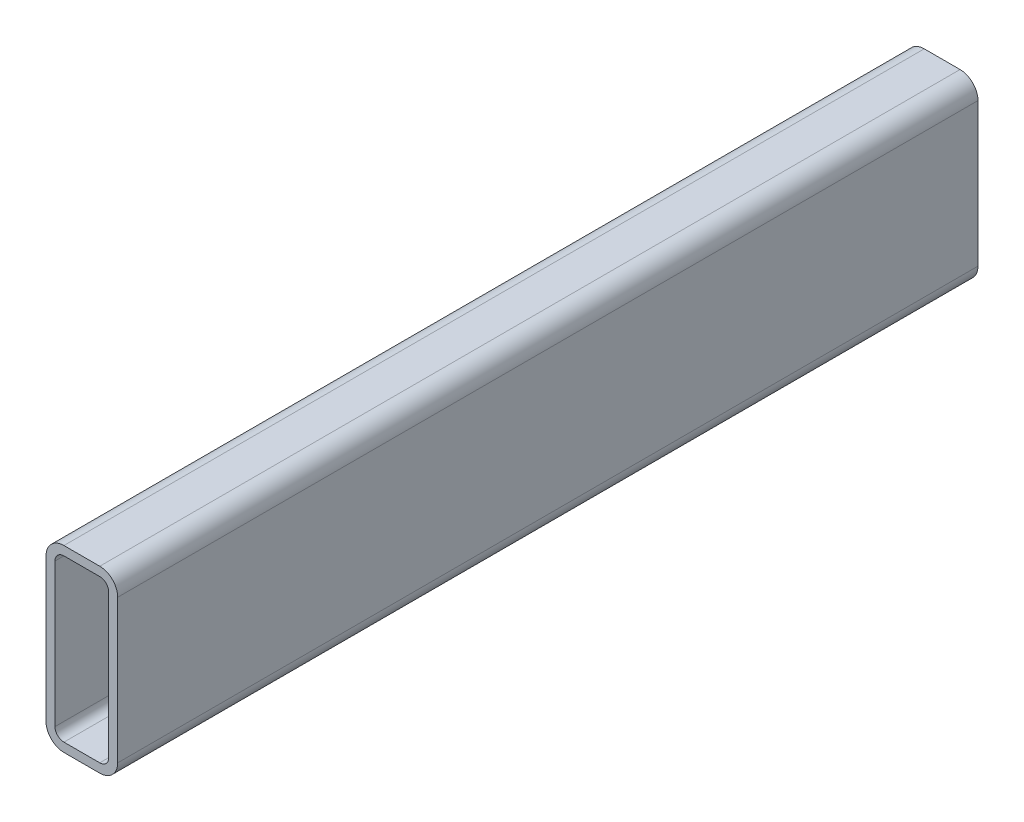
ISO-10303-21;
HEADER;
FILE_DESCRIPTION(('STEP AP214'),'2;1');
FILE_NAME('part.step','',(''),(''),'','','');
FILE_SCHEMA(('AUTOMOTIVE_DESIGN { 1 0 10303 214 1 1 1 1 }'));
ENDSEC;
DATA;
#1=APPLICATION_CONTEXT('core data for automotive mechanical design processes');
#2=APPLICATION_PROTOCOL_DEFINITION('international standard','automotive_design',2000,#1);
#3=PRODUCT_CONTEXT('',#1,'mechanical');
#4=PRODUCT('Part','Part','',(#3));
#5=PRODUCT_RELATED_PRODUCT_CATEGORY('part','',(#4));
#6=PRODUCT_DEFINITION_FORMATION('','',#4);
#7=PRODUCT_DEFINITION_CONTEXT('part definition',#1,'design');
#8=PRODUCT_DEFINITION('design','',#6,#7);
#9=PRODUCT_DEFINITION_SHAPE('','',#8);
#10=(LENGTH_UNIT() NAMED_UNIT(*) SI_UNIT(.MILLI.,.METRE.));
#11=(NAMED_UNIT(*) PLANE_ANGLE_UNIT() SI_UNIT($,.RADIAN.));
#12=(NAMED_UNIT(*) SI_UNIT($,.STERADIAN.) SOLID_ANGLE_UNIT());
#13=UNCERTAINTY_MEASURE_WITH_UNIT(LENGTH_MEASURE(1.E-05),#10,'distance_accuracy_value','');
#14=(GEOMETRIC_REPRESENTATION_CONTEXT(3) GLOBAL_UNCERTAINTY_ASSIGNED_CONTEXT((#13)) GLOBAL_UNIT_ASSIGNED_CONTEXT((#10,
#11,#12)) REPRESENTATION_CONTEXT('',''));
#15=CARTESIAN_POINT('',(0.,0.,0.));
#16=DIRECTION('',(0.,0.,1.));
#17=DIRECTION('',(1.,0.,0.));
#18=AXIS2_PLACEMENT_3D('',#15,#16,#17);
#19=CARTESIAN_POINT('',(6.35,57.15,304.8));
#20=DIRECTION('',(0.,0.,1.));
#21=DIRECTION('',(1.,0.,0.));
#22=AXIS2_PLACEMENT_3D('',#19,#20,#21);
#23=PLANE('',#22);
#24=CARTESIAN_POINT('',(6.35,57.15,304.8));
#25=DIRECTION('',(0.,0.,1.));
#26=DIRECTION('',(1.,0.,0.));
#27=AXIS2_PLACEMENT_3D('',#24,#25,#26);
#28=CIRCLE('',#27,6.35);
#29=CARTESIAN_POINT('',(6.35,63.5,304.8));
#30=VERTEX_POINT('',#29);
#31=CARTESIAN_POINT('',(0.,57.15,304.8));
#32=VERTEX_POINT('',#31);
#33=EDGE_CURVE('E213',#30,#32,#28,.T.);
#34=ORIENTED_EDGE('',*,*,#33,.T.);
#35=DIRECTION('',(0.,-1.,0.));
#36=VECTOR('',#35,1.);
#37=CARTESIAN_POINT('',(0.,6.35,304.8));
#38=LINE('',#37,#36);
#39=CARTESIAN_POINT('',(0.,6.35,304.8));
#40=VERTEX_POINT('',#39);
#41=EDGE_CURVE('E216',#32,#40,#38,.T.);
#42=ORIENTED_EDGE('',*,*,#41,.T.);
#43=CARTESIAN_POINT('',(6.35,6.35,304.8));
#44=DIRECTION('',(0.,0.,1.));
#45=DIRECTION('',(1.,0.,0.));
#46=AXIS2_PLACEMENT_3D('',#43,#44,#45);
#47=CIRCLE('',#46,6.35);
#48=CARTESIAN_POINT('',(6.35,0.,304.8));
#49=VERTEX_POINT('',#48);
#50=EDGE_CURVE('E219',#40,#49,#47,.T.);
#51=ORIENTED_EDGE('',*,*,#50,.T.);
#52=DIRECTION('',(1.,0.,0.));
#53=VECTOR('',#52,1.);
#54=CARTESIAN_POINT('',(19.05,0.,304.8));
#55=LINE('',#54,#53);
#56=CARTESIAN_POINT('',(19.05,0.,304.8));
#57=VERTEX_POINT('',#56);
#58=EDGE_CURVE('E221',#49,#57,#55,.T.);
#59=ORIENTED_EDGE('',*,*,#58,.T.);
#60=CARTESIAN_POINT('',(19.05,6.35,304.8));
#61=DIRECTION('',(0.,0.,1.));
#62=DIRECTION('',(1.,0.,0.));
#63=AXIS2_PLACEMENT_3D('',#60,#61,#62);
#64=CIRCLE('',#63,6.35);
#65=CARTESIAN_POINT('',(25.4,6.35,304.8));
#66=VERTEX_POINT('',#65);
#67=EDGE_CURVE('E223',#57,#66,#64,.T.);
#68=ORIENTED_EDGE('',*,*,#67,.T.);
#69=DIRECTION('',(0.,1.,0.));
#70=VECTOR('',#69,1.);
#71=CARTESIAN_POINT('',(25.4,57.15,304.8));
#72=LINE('',#71,#70);
#73=CARTESIAN_POINT('',(25.4,57.15,304.8));
#74=VERTEX_POINT('',#73);
#75=EDGE_CURVE('E225',#66,#74,#72,.T.);
#76=ORIENTED_EDGE('',*,*,#75,.T.);
#77=CARTESIAN_POINT('',(19.05,57.15,304.8));
#78=DIRECTION('',(0.,0.,1.));
#79=DIRECTION('',(1.,0.,0.));
#80=AXIS2_PLACEMENT_3D('',#77,#78,#79);
#81=CIRCLE('',#80,6.35);
#82=CARTESIAN_POINT('',(19.05,63.5,304.8));
#83=VERTEX_POINT('',#82);
#84=EDGE_CURVE('E227',#74,#83,#81,.T.);
#85=ORIENTED_EDGE('',*,*,#84,.T.);
#86=DIRECTION('',(-1.,0.,0.));
#87=VECTOR('',#86,1.);
#88=CARTESIAN_POINT('',(6.35,63.5,304.8));
#89=LINE('',#88,#87);
#90=EDGE_CURVE('E229',#83,#30,#89,.T.);
#91=ORIENTED_EDGE('',*,*,#90,.T.);
#92=EDGE_LOOP('',(#34,#42,#51,#59,#68,#76,#85,#91));
#93=FACE_BOUND('',#92,.T.);
#94=DIRECTION('',(0.,-1.,0.));
#95=VECTOR('',#94,1.);
#96=CARTESIAN_POINT('',(3.175,6.35,304.8));
#97=LINE('',#96,#95);
#98=CARTESIAN_POINT('',(3.175,57.15,304.8));
#99=VERTEX_POINT('',#98);
#100=CARTESIAN_POINT('',(3.175,6.35,304.8));
#101=VERTEX_POINT('',#100);
#102=EDGE_CURVE('E156',#99,#101,#97,.T.);
#103=ORIENTED_EDGE('',*,*,#102,.F.);
#104=CARTESIAN_POINT('',(6.35,57.15,304.8));
#105=DIRECTION('',(0.,0.,1.));
#106=DIRECTION('',(1.,0.,0.));
#107=AXIS2_PLACEMENT_3D('',#104,#105,#106);
#108=CIRCLE('',#107,3.17499999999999);
#109=CARTESIAN_POINT('',(6.35,60.325,304.8));
#110=VERTEX_POINT('',#109);
#111=EDGE_CURVE('E148',#110,#99,#108,.T.);
#112=ORIENTED_EDGE('',*,*,#111,.F.);
#113=DIRECTION('',(-1.,0.,0.));
#114=VECTOR('',#113,1.);
#115=CARTESIAN_POINT('',(6.35,60.325,304.8));
#116=LINE('',#115,#114);
#117=CARTESIAN_POINT('',(19.05,60.325,304.8));
#118=VERTEX_POINT('',#117);
#119=EDGE_CURVE('E181',#118,#110,#116,.T.);
#120=ORIENTED_EDGE('',*,*,#119,.F.);
#121=CARTESIAN_POINT('',(19.05,57.15,304.8));
#122=DIRECTION('',(0.,0.,1.));
#123=DIRECTION('',(1.,0.,0.));
#124=AXIS2_PLACEMENT_3D('',#121,#122,#123);
#125=CIRCLE('',#124,3.17499999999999);
#126=CARTESIAN_POINT('',(22.225,57.15,304.8));
#127=VERTEX_POINT('',#126);
#128=EDGE_CURVE('E179',#127,#118,#125,.T.);
#129=ORIENTED_EDGE('',*,*,#128,.F.);
#130=DIRECTION('',(0.,1.,0.));
#131=VECTOR('',#130,1.);
#132=CARTESIAN_POINT('',(22.225,57.15,304.8));
#133=LINE('',#132,#131);
#134=CARTESIAN_POINT('',(22.225,6.35,304.8));
#135=VERTEX_POINT('',#134);
#136=EDGE_CURVE('E177',#135,#127,#133,.T.);
#137=ORIENTED_EDGE('',*,*,#136,.F.);
#138=CARTESIAN_POINT('',(19.05,6.35,304.8));
#139=DIRECTION('',(0.,0.,1.));
#140=DIRECTION('',(1.,0.,0.));
#141=AXIS2_PLACEMENT_3D('',#138,#139,#140);
#142=CIRCLE('',#141,3.175);
#143=CARTESIAN_POINT('',(19.05,3.175,304.8));
#144=VERTEX_POINT('',#143);
#145=EDGE_CURVE('E175',#144,#135,#142,.T.);
#146=ORIENTED_EDGE('',*,*,#145,.F.);
#147=DIRECTION('',(1.,0.,0.));
#148=VECTOR('',#147,1.);
#149=CARTESIAN_POINT('',(19.05,3.175,304.8));
#150=LINE('',#149,#148);
#151=CARTESIAN_POINT('',(6.35,3.175,304.8));
#152=VERTEX_POINT('',#151);
#153=EDGE_CURVE('E171',#152,#144,#150,.T.);
#154=ORIENTED_EDGE('',*,*,#153,.F.);
#155=CARTESIAN_POINT('',(6.35,6.35,304.8));
#156=DIRECTION('',(0.,0.,1.));
#157=DIRECTION('',(1.,0.,0.));
#158=AXIS2_PLACEMENT_3D('',#155,#156,#157);
#159=CIRCLE('',#158,3.175);
#160=EDGE_CURVE('E169',#101,#152,#159,.T.);
#161=ORIENTED_EDGE('',*,*,#160,.F.);
#162=EDGE_LOOP('',(#103,#112,#120,#129,#137,#146,#154,#161));
#163=FACE_BOUND('',#162,.T.);
#164=ADVANCED_FACE('F35',(#93,#163),#23,.T.);
#165=CARTESIAN_POINT('',(6.35,57.15,0.));
#166=DIRECTION('',(0.,0.,1.));
#167=DIRECTION('',(1.,0.,0.));
#168=AXIS2_PLACEMENT_3D('',#165,#166,#167);
#169=PLANE('',#168);
#170=CARTESIAN_POINT('',(6.35,57.15,0.));
#171=DIRECTION('',(0.,0.,1.));
#172=DIRECTION('',(1.,0.,0.));
#173=AXIS2_PLACEMENT_3D('',#170,#171,#172);
#174=CIRCLE('',#173,6.35);
#175=CARTESIAN_POINT('',(6.35,63.5,0.));
#176=VERTEX_POINT('',#175);
#177=CARTESIAN_POINT('',(0.,57.15,0.));
#178=VERTEX_POINT('',#177);
#179=EDGE_CURVE('E164',#176,#178,#174,.T.);
#180=ORIENTED_EDGE('',*,*,#179,.F.);
#181=DIRECTION('',(-1.,0.,0.));
#182=VECTOR('',#181,1.);
#183=CARTESIAN_POINT('',(6.35,63.5,0.));
#184=LINE('',#183,#182);
#185=CARTESIAN_POINT('',(19.05,63.5,0.));
#186=VERTEX_POINT('',#185);
#187=EDGE_CURVE('E217',#186,#176,#184,.T.);
#188=ORIENTED_EDGE('',*,*,#187,.F.);
#189=CARTESIAN_POINT('',(19.05,57.15,0.));
#190=DIRECTION('',(0.,0.,1.));
#191=DIRECTION('',(1.,0.,0.));
#192=AXIS2_PLACEMENT_3D('',#189,#190,#191);
#193=CIRCLE('',#192,6.35);
#194=CARTESIAN_POINT('',(25.4,57.15,0.));
#195=VERTEX_POINT('',#194);
#196=EDGE_CURVE('E244',#195,#186,#193,.T.);
#197=ORIENTED_EDGE('',*,*,#196,.F.);
#198=DIRECTION('',(0.,1.,0.));
#199=VECTOR('',#198,1.);
#200=CARTESIAN_POINT('',(25.4,57.15,0.));
#201=LINE('',#200,#199);
#202=CARTESIAN_POINT('',(25.4,6.35,0.));
#203=VERTEX_POINT('',#202);
#204=EDGE_CURVE('E242',#203,#195,#201,.T.);
#205=ORIENTED_EDGE('',*,*,#204,.F.);
#206=CARTESIAN_POINT('',(19.05,6.35,0.));
#207=DIRECTION('',(0.,0.,1.));
#208=DIRECTION('',(1.,0.,0.));
#209=AXIS2_PLACEMENT_3D('',#206,#207,#208);
#210=CIRCLE('',#209,6.35);
#211=CARTESIAN_POINT('',(19.05,0.,0.));
#212=VERTEX_POINT('',#211);
#213=EDGE_CURVE('E240',#212,#203,#210,.T.);
#214=ORIENTED_EDGE('',*,*,#213,.F.);
#215=DIRECTION('',(1.,0.,0.));
#216=VECTOR('',#215,1.);
#217=CARTESIAN_POINT('',(19.05,0.,0.));
#218=LINE('',#217,#216);
#219=CARTESIAN_POINT('',(6.35,0.,0.));
#220=VERTEX_POINT('',#219);
#221=EDGE_CURVE('E238',#220,#212,#218,.T.);
#222=ORIENTED_EDGE('',*,*,#221,.F.);
#223=CARTESIAN_POINT('',(6.35,6.35,0.));
#224=DIRECTION('',(0.,0.,1.));
#225=DIRECTION('',(1.,0.,0.));
#226=AXIS2_PLACEMENT_3D('',#223,#224,#225);
#227=CIRCLE('',#226,6.35);
#228=CARTESIAN_POINT('',(0.,6.35,0.));
#229=VERTEX_POINT('',#228);
#230=EDGE_CURVE('E236',#229,#220,#227,.T.);
#231=ORIENTED_EDGE('',*,*,#230,.F.);
#232=DIRECTION('',(0.,-1.,0.));
#233=VECTOR('',#232,1.);
#234=CARTESIAN_POINT('',(0.,6.35,0.));
#235=LINE('',#234,#233);
#236=EDGE_CURVE('E234',#178,#229,#235,.T.);
#237=ORIENTED_EDGE('',*,*,#236,.F.);
#238=EDGE_LOOP('',(#180,#188,#197,#205,#214,#222,#231,#237));
#239=FACE_BOUND('',#238,.T.);
#240=CARTESIAN_POINT('',(6.35,57.15,0.));
#241=DIRECTION('',(0.,0.,1.));
#242=DIRECTION('',(1.,0.,0.));
#243=AXIS2_PLACEMENT_3D('',#240,#241,#242);
#244=CIRCLE('',#243,3.17499999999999);
#245=CARTESIAN_POINT('',(6.35,60.325,0.));
#246=VERTEX_POINT('',#245);
#247=CARTESIAN_POINT('',(3.175,57.15,0.));
#248=VERTEX_POINT('',#247);
#249=EDGE_CURVE('E58',#246,#248,#244,.T.);
#250=ORIENTED_EDGE('',*,*,#249,.T.);
#251=DIRECTION('',(0.,-1.,0.));
#252=VECTOR('',#251,1.);
#253=CARTESIAN_POINT('',(3.175,6.35,0.));
#254=LINE('',#253,#252);
#255=CARTESIAN_POINT('',(3.175,6.35,0.));
#256=VERTEX_POINT('',#255);
#257=EDGE_CURVE('E163',#248,#256,#254,.T.);
#258=ORIENTED_EDGE('',*,*,#257,.T.);
#259=CARTESIAN_POINT('',(6.35,6.35,0.));
#260=DIRECTION('',(0.,0.,1.));
#261=DIRECTION('',(1.,0.,0.));
#262=AXIS2_PLACEMENT_3D('',#259,#260,#261);
#263=CIRCLE('',#262,3.175);
#264=CARTESIAN_POINT('',(6.35,3.175,0.));
#265=VERTEX_POINT('',#264);
#266=EDGE_CURVE('E185',#256,#265,#263,.T.);
#267=ORIENTED_EDGE('',*,*,#266,.T.);
#268=DIRECTION('',(1.,0.,0.));
#269=VECTOR('',#268,1.);
#270=CARTESIAN_POINT('',(19.05,3.175,0.));
#271=LINE('',#270,#269);
#272=CARTESIAN_POINT('',(19.05,3.175,0.));
#273=VERTEX_POINT('',#272);
#274=EDGE_CURVE('E188',#265,#273,#271,.T.);
#275=ORIENTED_EDGE('',*,*,#274,.T.);
#276=CARTESIAN_POINT('',(19.05,6.35,0.));
#277=DIRECTION('',(0.,0.,1.));
#278=DIRECTION('',(1.,0.,0.));
#279=AXIS2_PLACEMENT_3D('',#276,#277,#278);
#280=CIRCLE('',#279,3.175);
#281=CARTESIAN_POINT('',(22.225,6.35,0.));
#282=VERTEX_POINT('',#281);
#283=EDGE_CURVE('E191',#273,#282,#280,.T.);
#284=ORIENTED_EDGE('',*,*,#283,.T.);
#285=DIRECTION('',(0.,1.,0.));
#286=VECTOR('',#285,1.);
#287=CARTESIAN_POINT('',(22.225,57.15,0.));
#288=LINE('',#287,#286);
#289=CARTESIAN_POINT('',(22.225,57.15,0.));
#290=VERTEX_POINT('',#289);
#291=EDGE_CURVE('E194',#282,#290,#288,.T.);
#292=ORIENTED_EDGE('',*,*,#291,.T.);
#293=CARTESIAN_POINT('',(19.05,57.15,0.));
#294=DIRECTION('',(0.,0.,1.));
#295=DIRECTION('',(1.,0.,0.));
#296=AXIS2_PLACEMENT_3D('',#293,#294,#295);
#297=CIRCLE('',#296,3.17499999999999);
#298=CARTESIAN_POINT('',(19.05,60.325,0.));
#299=VERTEX_POINT('',#298);
#300=EDGE_CURVE('E197',#290,#299,#297,.T.);
#301=ORIENTED_EDGE('',*,*,#300,.T.);
#302=DIRECTION('',(-1.,0.,0.));
#303=VECTOR('',#302,1.);
#304=CARTESIAN_POINT('',(6.35,60.325,0.));
#305=LINE('',#304,#303);
#306=EDGE_CURVE('E157',#299,#246,#305,.T.);
#307=ORIENTED_EDGE('',*,*,#306,.T.);
#308=EDGE_LOOP('',(#250,#258,#267,#275,#284,#292,#301,#307));
#309=FACE_BOUND('',#308,.T.);
#310=ADVANCED_FACE('F274',(#239,#309),#169,.F.);
#311=CARTESIAN_POINT('',(6.35,57.15,304.8));
#312=DIRECTION('',(0.,0.,-1.));
#313=DIRECTION('',(-1.,0.,0.));
#314=AXIS2_PLACEMENT_3D('',#311,#312,#313);
#315=CYLINDRICAL_SURFACE('',#314,6.35);
#316=ORIENTED_EDGE('',*,*,#179,.T.);
#317=DIRECTION('',(0.,0.,-1.));
#318=VECTOR('',#317,1.);
#319=CARTESIAN_POINT('',(0.,57.15,304.8));
#320=LINE('',#319,#318);
#321=EDGE_CURVE('E11',#32,#178,#320,.T.);
#322=ORIENTED_EDGE('',*,*,#321,.F.);
#323=ORIENTED_EDGE('',*,*,#33,.F.);
#324=DIRECTION('',(0.,0.,-1.));
#325=VECTOR('',#324,1.);
#326=CARTESIAN_POINT('',(6.35,63.5,304.8));
#327=LINE('',#326,#325);
#328=EDGE_CURVE('E231',#30,#176,#327,.T.);
#329=ORIENTED_EDGE('',*,*,#328,.T.);
#330=EDGE_LOOP('',(#316,#322,#323,#329));
#331=FACE_BOUND('',#330,.T.);
#332=ADVANCED_FACE('F37',(#331),#315,.T.);
#333=CARTESIAN_POINT('',(0.,6.35,304.8));
#334=DIRECTION('',(1.,0.,0.));
#335=DIRECTION('',(0.,0.,-1.));
#336=AXIS2_PLACEMENT_3D('',#333,#334,#335);
#337=PLANE('',#336);
#338=ORIENTED_EDGE('',*,*,#236,.T.);
#339=DIRECTION('',(0.,0.,-1.));
#340=VECTOR('',#339,1.);
#341=CARTESIAN_POINT('',(0.,6.35,304.8));
#342=LINE('',#341,#340);
#343=EDGE_CURVE('E43',#40,#229,#342,.T.);
#344=ORIENTED_EDGE('',*,*,#343,.F.);
#345=ORIENTED_EDGE('',*,*,#41,.F.);
#346=ORIENTED_EDGE('',*,*,#321,.T.);
#347=EDGE_LOOP('',(#338,#344,#345,#346));
#348=FACE_BOUND('',#347,.T.);
#349=ADVANCED_FACE('F291',(#348),#337,.F.);
#350=CARTESIAN_POINT('',(6.35,6.35,304.8));
#351=DIRECTION('',(0.,0.,-1.));
#352=DIRECTION('',(-1.,0.,0.));
#353=AXIS2_PLACEMENT_3D('',#350,#351,#352);
#354=CYLINDRICAL_SURFACE('',#353,6.35);
#355=ORIENTED_EDGE('',*,*,#230,.T.);
#356=DIRECTION('',(0.,0.,-1.));
#357=VECTOR('',#356,1.);
#358=CARTESIAN_POINT('',(6.35,0.,304.8));
#359=LINE('',#358,#357);
#360=EDGE_CURVE('E261',#49,#220,#359,.T.);
#361=ORIENTED_EDGE('',*,*,#360,.F.);
#362=ORIENTED_EDGE('',*,*,#50,.F.);
#363=ORIENTED_EDGE('',*,*,#343,.T.);
#364=EDGE_LOOP('',(#355,#361,#362,#363));
#365=FACE_BOUND('',#364,.T.);
#366=ADVANCED_FACE('F268',(#365),#354,.T.);
#367=CARTESIAN_POINT('',(19.05,0.,304.8));
#368=DIRECTION('',(0.,1.,0.));
#369=DIRECTION('',(0.,0.,1.));
#370=AXIS2_PLACEMENT_3D('',#367,#368,#369);
#371=PLANE('',#370);
#372=ORIENTED_EDGE('',*,*,#221,.T.);
#373=DIRECTION('',(0.,0.,-1.));
#374=VECTOR('',#373,1.);
#375=CARTESIAN_POINT('',(19.05,0.,304.8));
#376=LINE('',#375,#374);
#377=EDGE_CURVE('E258',#57,#212,#376,.T.);
#378=ORIENTED_EDGE('',*,*,#377,.F.);
#379=ORIENTED_EDGE('',*,*,#58,.F.);
#380=ORIENTED_EDGE('',*,*,#360,.T.);
#381=EDGE_LOOP('',(#372,#378,#379,#380));
#382=FACE_BOUND('',#381,.T.);
#383=ADVANCED_FACE('F280',(#382),#371,.F.);
#384=CARTESIAN_POINT('',(19.05,6.35,304.8));
#385=DIRECTION('',(0.,0.,-1.));
#386=DIRECTION('',(-1.,0.,0.));
#387=AXIS2_PLACEMENT_3D('',#384,#385,#386);
#388=CYLINDRICAL_SURFACE('',#387,6.35);
#389=ORIENTED_EDGE('',*,*,#213,.T.);
#390=DIRECTION('',(0.,0.,-1.));
#391=VECTOR('',#390,1.);
#392=CARTESIAN_POINT('',(25.4,6.35,304.8));
#393=LINE('',#392,#391);
#394=EDGE_CURVE('E255',#66,#203,#393,.T.);
#395=ORIENTED_EDGE('',*,*,#394,.F.);
#396=ORIENTED_EDGE('',*,*,#67,.F.);
#397=ORIENTED_EDGE('',*,*,#377,.T.);
#398=EDGE_LOOP('',(#389,#395,#396,#397));
#399=FACE_BOUND('',#398,.T.);
#400=ADVANCED_FACE('F284',(#399),#388,.T.);
#401=CARTESIAN_POINT('',(25.4,57.15,304.8));
#402=DIRECTION('',(-1.,0.,0.));
#403=DIRECTION('',(0.,0.,1.));
#404=AXIS2_PLACEMENT_3D('',#401,#402,#403);
#405=PLANE('',#404);
#406=ORIENTED_EDGE('',*,*,#204,.T.);
#407=DIRECTION('',(0.,0.,-1.));
#408=VECTOR('',#407,1.);
#409=CARTESIAN_POINT('',(25.4,57.15,304.8));
#410=LINE('',#409,#408);
#411=EDGE_CURVE('E252',#74,#195,#410,.T.);
#412=ORIENTED_EDGE('',*,*,#411,.F.);
#413=ORIENTED_EDGE('',*,*,#75,.F.);
#414=ORIENTED_EDGE('',*,*,#394,.T.);
#415=EDGE_LOOP('',(#406,#412,#413,#414));
#416=FACE_BOUND('',#415,.T.);
#417=ADVANCED_FACE('F304',(#416),#405,.F.);
#418=CARTESIAN_POINT('',(19.05,57.15,304.8));
#419=DIRECTION('',(0.,0.,-1.));
#420=DIRECTION('',(-1.,0.,0.));
#421=AXIS2_PLACEMENT_3D('',#418,#419,#420);
#422=CYLINDRICAL_SURFACE('',#421,6.35);
#423=ORIENTED_EDGE('',*,*,#196,.T.);
#424=DIRECTION('',(0.,0.,-1.));
#425=VECTOR('',#424,1.);
#426=CARTESIAN_POINT('',(19.05,63.5,304.8));
#427=LINE('',#426,#425);
#428=EDGE_CURVE('E249',#83,#186,#427,.T.);
#429=ORIENTED_EDGE('',*,*,#428,.F.);
#430=ORIENTED_EDGE('',*,*,#84,.F.);
#431=ORIENTED_EDGE('',*,*,#411,.T.);
#432=EDGE_LOOP('',(#423,#429,#430,#431));
#433=FACE_BOUND('',#432,.T.);
#434=ADVANCED_FACE('F302',(#433),#422,.T.);
#435=CARTESIAN_POINT('',(6.35,63.5,304.8));
#436=DIRECTION('',(0.,-1.,0.));
#437=DIRECTION('',(0.,0.,-1.));
#438=AXIS2_PLACEMENT_3D('',#435,#436,#437);
#439=PLANE('',#438);
#440=ORIENTED_EDGE('',*,*,#187,.T.);
#441=ORIENTED_EDGE('',*,*,#328,.F.);
#442=ORIENTED_EDGE('',*,*,#90,.F.);
#443=ORIENTED_EDGE('',*,*,#428,.T.);
#444=EDGE_LOOP('',(#440,#441,#442,#443));
#445=FACE_BOUND('',#444,.T.);
#446=ADVANCED_FACE('F297',(#445),#439,.F.);
#447=CARTESIAN_POINT('',(6.35,57.15,304.8));
#448=DIRECTION('',(0.,0.,-1.));
#449=DIRECTION('',(-1.,0.,0.));
#450=AXIS2_PLACEMENT_3D('',#447,#448,#449);
#451=CYLINDRICAL_SURFACE('',#450,3.17499999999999);
#452=ORIENTED_EDGE('',*,*,#249,.F.);
#453=DIRECTION('',(0.,0.,-1.));
#454=VECTOR('',#453,1.);
#455=CARTESIAN_POINT('',(6.35,60.325,304.8));
#456=LINE('',#455,#454);
#457=EDGE_CURVE('E152',#110,#246,#456,.T.);
#458=ORIENTED_EDGE('',*,*,#457,.F.);
#459=ORIENTED_EDGE('',*,*,#111,.T.);
#460=DIRECTION('',(0.,0.,-1.));
#461=VECTOR('',#460,1.);
#462=CARTESIAN_POINT('',(3.175,57.15,304.8));
#463=LINE('',#462,#461);
#464=EDGE_CURVE('E151',#99,#248,#463,.T.);
#465=ORIENTED_EDGE('',*,*,#464,.T.);
#466=EDGE_LOOP('',(#452,#458,#459,#465));
#467=FACE_BOUND('',#466,.T.);
#468=ADVANCED_FACE('F150',(#467),#451,.F.);
#469=CARTESIAN_POINT('',(3.175,6.35,304.8));
#470=DIRECTION('',(1.,0.,0.));
#471=DIRECTION('',(0.,0.,-1.));
#472=AXIS2_PLACEMENT_3D('',#469,#470,#471);
#473=PLANE('',#472);
#474=ORIENTED_EDGE('',*,*,#257,.F.);
#475=ORIENTED_EDGE('',*,*,#464,.F.);
#476=ORIENTED_EDGE('',*,*,#102,.T.);
#477=DIRECTION('',(0.,0.,-1.));
#478=VECTOR('',#477,1.);
#479=CARTESIAN_POINT('',(3.175,6.35,304.8));
#480=LINE('',#479,#478);
#481=EDGE_CURVE('E165',#101,#256,#480,.T.);
#482=ORIENTED_EDGE('',*,*,#481,.T.);
#483=EDGE_LOOP('',(#474,#475,#476,#482));
#484=FACE_BOUND('',#483,.T.);
#485=ADVANCED_FACE('F160',(#484),#473,.T.);
#486=CARTESIAN_POINT('',(6.35,6.35,304.8));
#487=DIRECTION('',(0.,0.,-1.));
#488=DIRECTION('',(-1.,0.,0.));
#489=AXIS2_PLACEMENT_3D('',#486,#487,#488);
#490=CYLINDRICAL_SURFACE('',#489,3.175);
#491=ORIENTED_EDGE('',*,*,#266,.F.);
#492=ORIENTED_EDGE('',*,*,#481,.F.);
#493=ORIENTED_EDGE('',*,*,#160,.T.);
#494=DIRECTION('',(0.,0.,-1.));
#495=VECTOR('',#494,1.);
#496=CARTESIAN_POINT('',(6.35,3.175,304.8));
#497=LINE('',#496,#495);
#498=EDGE_CURVE('E210',#152,#265,#497,.T.);
#499=ORIENTED_EDGE('',*,*,#498,.T.);
#500=EDGE_LOOP('',(#491,#492,#493,#499));
#501=FACE_BOUND('',#500,.T.);
#502=ADVANCED_FACE('F329',(#501),#490,.F.);
#503=CARTESIAN_POINT('',(19.05,3.175,304.8));
#504=DIRECTION('',(0.,1.,0.));
#505=DIRECTION('',(0.,0.,1.));
#506=AXIS2_PLACEMENT_3D('',#503,#504,#505);
#507=PLANE('',#506);
#508=ORIENTED_EDGE('',*,*,#274,.F.);
#509=ORIENTED_EDGE('',*,*,#498,.F.);
#510=ORIENTED_EDGE('',*,*,#153,.T.);
#511=DIRECTION('',(0.,0.,-1.));
#512=VECTOR('',#511,1.);
#513=CARTESIAN_POINT('',(19.05,3.175,304.8));
#514=LINE('',#513,#512);
#515=EDGE_CURVE('E208',#144,#273,#514,.T.);
#516=ORIENTED_EDGE('',*,*,#515,.T.);
#517=EDGE_LOOP('',(#508,#509,#510,#516));
#518=FACE_BOUND('',#517,.T.);
#519=ADVANCED_FACE('F333',(#518),#507,.T.);
#520=CARTESIAN_POINT('',(19.05,6.35,304.8));
#521=DIRECTION('',(0.,0.,-1.));
#522=DIRECTION('',(-1.,0.,0.));
#523=AXIS2_PLACEMENT_3D('',#520,#521,#522);
#524=CYLINDRICAL_SURFACE('',#523,3.175);
#525=ORIENTED_EDGE('',*,*,#283,.F.);
#526=ORIENTED_EDGE('',*,*,#515,.F.);
#527=ORIENTED_EDGE('',*,*,#145,.T.);
#528=DIRECTION('',(0.,0.,-1.));
#529=VECTOR('',#528,1.);
#530=CARTESIAN_POINT('',(22.225,6.35,304.8));
#531=LINE('',#530,#529);
#532=EDGE_CURVE('E206',#135,#282,#531,.T.);
#533=ORIENTED_EDGE('',*,*,#532,.T.);
#534=EDGE_LOOP('',(#525,#526,#527,#533));
#535=FACE_BOUND('',#534,.T.);
#536=ADVANCED_FACE('F339',(#535),#524,.F.);
#537=CARTESIAN_POINT('',(22.225,57.15,304.8));
#538=DIRECTION('',(-1.,0.,0.));
#539=DIRECTION('',(0.,0.,1.));
#540=AXIS2_PLACEMENT_3D('',#537,#538,#539);
#541=PLANE('',#540);
#542=ORIENTED_EDGE('',*,*,#291,.F.);
#543=ORIENTED_EDGE('',*,*,#532,.F.);
#544=ORIENTED_EDGE('',*,*,#136,.T.);
#545=DIRECTION('',(0.,0.,-1.));
#546=VECTOR('',#545,1.);
#547=CARTESIAN_POINT('',(22.225,57.15,304.8));
#548=LINE('',#547,#546);
#549=EDGE_CURVE('E204',#127,#290,#548,.T.);
#550=ORIENTED_EDGE('',*,*,#549,.T.);
#551=EDGE_LOOP('',(#542,#543,#544,#550));
#552=FACE_BOUND('',#551,.T.);
#553=ADVANCED_FACE('F343',(#552),#541,.T.);
#554=CARTESIAN_POINT('',(19.05,57.15,304.8));
#555=DIRECTION('',(0.,0.,-1.));
#556=DIRECTION('',(-1.,0.,0.));
#557=AXIS2_PLACEMENT_3D('',#554,#555,#556);
#558=CYLINDRICAL_SURFACE('',#557,3.17499999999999);
#559=ORIENTED_EDGE('',*,*,#300,.F.);
#560=ORIENTED_EDGE('',*,*,#549,.F.);
#561=ORIENTED_EDGE('',*,*,#128,.T.);
#562=DIRECTION('',(0.,0.,-1.));
#563=VECTOR('',#562,1.);
#564=CARTESIAN_POINT('',(19.05,60.325,304.8));
#565=LINE('',#564,#563);
#566=EDGE_CURVE('E50',#118,#299,#565,.T.);
#567=ORIENTED_EDGE('',*,*,#566,.T.);
#568=EDGE_LOOP('',(#559,#560,#561,#567));
#569=FACE_BOUND('',#568,.T.);
#570=ADVANCED_FACE('F347',(#569),#558,.F.);
#571=CARTESIAN_POINT('',(6.35,60.325,304.8));
#572=DIRECTION('',(0.,-1.,0.));
#573=DIRECTION('',(0.,0.,-1.));
#574=AXIS2_PLACEMENT_3D('',#571,#572,#573);
#575=PLANE('',#574);
#576=ORIENTED_EDGE('',*,*,#306,.F.);
#577=ORIENTED_EDGE('',*,*,#566,.F.);
#578=ORIENTED_EDGE('',*,*,#119,.T.);
#579=ORIENTED_EDGE('',*,*,#457,.T.);
#580=EDGE_LOOP('',(#576,#577,#578,#579));
#581=FACE_BOUND('',#580,.T.);
#582=ADVANCED_FACE('F351',(#581),#575,.T.);
#583=CLOSED_SHELL('',(#164,#310,#332,#349,#366,#383,#400,#417,#434,#446,#468,#485,#502,#519,
#536,#553,#570,#582));
#584=MANIFOLD_SOLID_BREP('B2',#583);
#585=ADVANCED_BREP_SHAPE_REPRESENTATION('',(#18,#584),#14);
#586=SHAPE_DEFINITION_REPRESENTATION(#9,#585);
ENDSEC;
END-ISO-10303-21;
